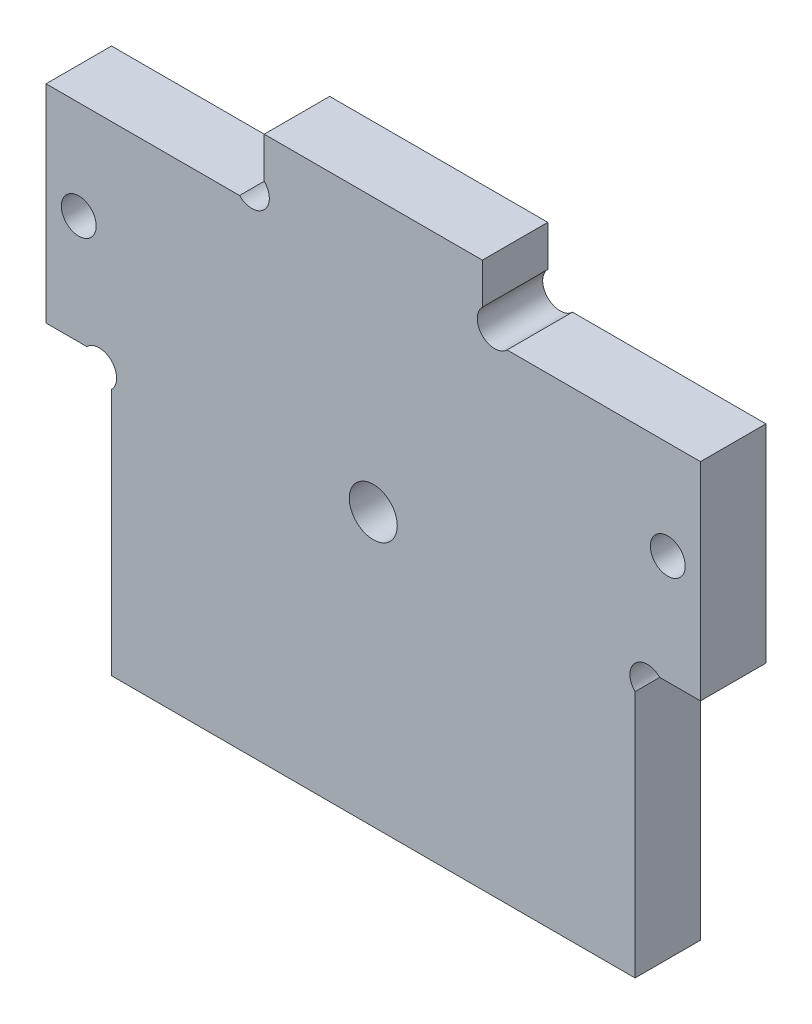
ISO-10303-21;
HEADER;
FILE_DESCRIPTION(('STEP AP214'),'2;1');
FILE_NAME('part.step','',(''),(''),'','','');
FILE_SCHEMA(('AUTOMOTIVE_DESIGN { 1 0 10303 214 1 1 1 1 }'));
ENDSEC;
DATA;
#1=APPLICATION_CONTEXT('core data for automotive mechanical design processes');
#2=APPLICATION_PROTOCOL_DEFINITION('international standard','automotive_design',2000,#1);
#3=PRODUCT_CONTEXT('',#1,'mechanical');
#4=PRODUCT('Part','Part','',(#3));
#5=PRODUCT_RELATED_PRODUCT_CATEGORY('part','',(#4));
#6=PRODUCT_DEFINITION_FORMATION('','',#4);
#7=PRODUCT_DEFINITION_CONTEXT('part definition',#1,'design');
#8=PRODUCT_DEFINITION('design','',#6,#7);
#9=PRODUCT_DEFINITION_SHAPE('','',#8);
#10=(LENGTH_UNIT() NAMED_UNIT(*) SI_UNIT(.MILLI.,.METRE.));
#11=(NAMED_UNIT(*) PLANE_ANGLE_UNIT() SI_UNIT($,.RADIAN.));
#12=(NAMED_UNIT(*) SI_UNIT($,.STERADIAN.) SOLID_ANGLE_UNIT());
#13=UNCERTAINTY_MEASURE_WITH_UNIT(LENGTH_MEASURE(1.E-05),#10,'distance_accuracy_value','');
#14=(GEOMETRIC_REPRESENTATION_CONTEXT(3) GLOBAL_UNCERTAINTY_ASSIGNED_CONTEXT((#13)) GLOBAL_UNIT_ASSIGNED_CONTEXT((#10,
#11,#12)) REPRESENTATION_CONTEXT('',''));
#15=CARTESIAN_POINT('',(0.,0.,0.));
#16=DIRECTION('',(0.,0.,1.));
#17=DIRECTION('',(1.,0.,0.));
#18=AXIS2_PLACEMENT_3D('',#15,#16,#17);
#19=CARTESIAN_POINT('',(11.1313708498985,45.1313708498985,6.));
#20=DIRECTION('',(0.,0.,1.));
#21=DIRECTION('',(1.,0.,0.));
#22=AXIS2_PLACEMENT_3D('',#19,#20,#21);
#23=PLANE('',#22);
#24=CARTESIAN_POINT('',(-27.,35.,6.));
#25=DIRECTION('',(0.,0.,1.));
#26=DIRECTION('',(-1.,0.,0.));
#27=AXIS2_PLACEMENT_3D('',#24,#25,#26);
#28=CIRCLE('',#27,1.6);
#29=CARTESIAN_POINT('',(-28.6,35.,6.));
#30=VERTEX_POINT('',#29);
#31=EDGE_CURVE('E343',#30,#30,#28,.T.);
#32=ORIENTED_EDGE('',*,*,#31,.F.);
#33=EDGE_LOOP('',(#32));
#34=FACE_BOUND('',#33,.T.);
#35=CARTESIAN_POINT('',(11.1313708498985,45.1313708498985,6.));
#36=DIRECTION('',(0.,0.,-1.));
#37=DIRECTION('',(1.,0.,0.));
#38=AXIS2_PLACEMENT_3D('',#35,#36,#37);
#39=CIRCLE('',#38,1.60000000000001);
#40=CARTESIAN_POINT('',(12.262741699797,44.,6.));
#41=VERTEX_POINT('',#40);
#42=CARTESIAN_POINT('',(10.,46.262741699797,6.));
#43=VERTEX_POINT('',#42);
#44=EDGE_CURVE('E213',#41,#43,#39,.T.);
#45=ORIENTED_EDGE('',*,*,#44,.T.);
#46=DIRECTION('',(0.,1.,0.));
#47=VECTOR('',#46,1.);
#48=CARTESIAN_POINT('',(10.,46.262741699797,6.));
#49=LINE('',#48,#47);
#50=CARTESIAN_POINT('',(10.,50.,6.));
#51=VERTEX_POINT('',#50);
#52=EDGE_CURVE('E121',#43,#51,#49,.T.);
#53=ORIENTED_EDGE('',*,*,#52,.T.);
#54=DIRECTION('',(-1.,0.,0.));
#55=VECTOR('',#54,1.);
#56=CARTESIAN_POINT('',(-10.,50.,6.));
#57=LINE('',#56,#55);
#58=CARTESIAN_POINT('',(-10.,50.,6.));
#59=VERTEX_POINT('',#58);
#60=EDGE_CURVE('E252',#51,#59,#57,.T.);
#61=ORIENTED_EDGE('',*,*,#60,.T.);
#62=DIRECTION('',(0.,-1.,0.));
#63=VECTOR('',#62,1.);
#64=CARTESIAN_POINT('',(-10.,46.262741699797,6.));
#65=LINE('',#64,#63);
#66=CARTESIAN_POINT('',(-10.,46.262741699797,6.));
#67=VERTEX_POINT('',#66);
#68=EDGE_CURVE('E271',#59,#67,#65,.T.);
#69=ORIENTED_EDGE('',*,*,#68,.T.);
#70=CARTESIAN_POINT('',(-11.1313708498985,45.1313708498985,6.));
#71=DIRECTION('',(0.,0.,-1.));
#72=DIRECTION('',(-1.,0.,0.));
#73=AXIS2_PLACEMENT_3D('',#70,#71,#72);
#74=CIRCLE('',#73,1.60000000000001);
#75=CARTESIAN_POINT('',(-12.262741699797,44.,6.));
#76=VERTEX_POINT('',#75);
#77=EDGE_CURVE('E268',#67,#76,#74,.T.);
#78=ORIENTED_EDGE('',*,*,#77,.T.);
#79=DIRECTION('',(-1.,0.,0.));
#80=VECTOR('',#79,1.);
#81=CARTESIAN_POINT('',(-12.262741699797,44.,6.));
#82=LINE('',#81,#80);
#83=CARTESIAN_POINT('',(-30.,44.,6.));
#84=VERTEX_POINT('',#83);
#85=EDGE_CURVE('E270',#76,#84,#82,.T.);
#86=ORIENTED_EDGE('',*,*,#85,.T.);
#87=DIRECTION('',(0.,-1.,0.));
#88=VECTOR('',#87,1.);
#89=CARTESIAN_POINT('',(-30.,44.,6.));
#90=LINE('',#89,#88);
#91=CARTESIAN_POINT('',(-30.,25.,6.));
#92=VERTEX_POINT('',#91);
#93=EDGE_CURVE('E273',#84,#92,#90,.T.);
#94=ORIENTED_EDGE('',*,*,#93,.T.);
#95=DIRECTION('',(1.,0.,0.));
#96=VECTOR('',#95,1.);
#97=CARTESIAN_POINT('',(-30.,25.,6.));
#98=LINE('',#97,#96);
#99=CARTESIAN_POINT('',(-26.262741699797,25.,6.));
#100=VERTEX_POINT('',#99);
#101=EDGE_CURVE('E279',#92,#100,#98,.T.);
#102=ORIENTED_EDGE('',*,*,#101,.T.);
#103=CARTESIAN_POINT('',(-25.1313708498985,23.8686291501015,6.));
#104=DIRECTION('',(0.,0.,-1.));
#105=DIRECTION('',(-1.,0.,0.));
#106=AXIS2_PLACEMENT_3D('',#103,#104,#105);
#107=CIRCLE('',#106,1.60000000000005);
#108=CARTESIAN_POINT('',(-24.,22.737258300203,6.));
#109=VERTEX_POINT('',#108);
#110=EDGE_CURVE('E281',#100,#109,#107,.T.);
#111=ORIENTED_EDGE('',*,*,#110,.T.);
#112=DIRECTION('',(0.,-1.,0.));
#113=VECTOR('',#112,1.);
#114=CARTESIAN_POINT('',(-24.,22.737258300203,6.));
#115=LINE('',#114,#113);
#116=CARTESIAN_POINT('',(-24.,0.,6.));
#117=VERTEX_POINT('',#116);
#118=EDGE_CURVE('E283',#109,#117,#115,.T.);
#119=ORIENTED_EDGE('',*,*,#118,.T.);
#120=DIRECTION('',(1.,0.,0.));
#121=VECTOR('',#120,1.);
#122=CARTESIAN_POINT('',(-24.,0.,6.));
#123=LINE('',#122,#121);
#124=CARTESIAN_POINT('',(24.,0.,6.));
#125=VERTEX_POINT('',#124);
#126=EDGE_CURVE('E285',#117,#125,#123,.T.);
#127=ORIENTED_EDGE('',*,*,#126,.T.);
#128=DIRECTION('',(0.,1.,0.));
#129=VECTOR('',#128,1.);
#130=CARTESIAN_POINT('',(24.,22.737258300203,6.));
#131=LINE('',#130,#129);
#132=CARTESIAN_POINT('',(24.,22.737258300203,6.));
#133=VERTEX_POINT('',#132);
#134=EDGE_CURVE('E287',#125,#133,#131,.T.);
#135=ORIENTED_EDGE('',*,*,#134,.T.);
#136=CARTESIAN_POINT('',(25.1313708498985,23.8686291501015,6.));
#137=DIRECTION('',(0.,0.,-1.));
#138=DIRECTION('',(1.,0.,0.));
#139=AXIS2_PLACEMENT_3D('',#136,#137,#138);
#140=CIRCLE('',#139,1.60000000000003);
#141=CARTESIAN_POINT('',(26.262741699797,25.,6.));
#142=VERTEX_POINT('',#141);
#143=EDGE_CURVE('E164',#133,#142,#140,.T.);
#144=ORIENTED_EDGE('',*,*,#143,.T.);
#145=DIRECTION('',(1.,0.,0.));
#146=VECTOR('',#145,1.);
#147=CARTESIAN_POINT('',(30.,25.,6.));
#148=LINE('',#147,#146);
#149=CARTESIAN_POINT('',(30.,25.,6.));
#150=VERTEX_POINT('',#149);
#151=EDGE_CURVE('E158',#142,#150,#148,.T.);
#152=ORIENTED_EDGE('',*,*,#151,.T.);
#153=DIRECTION('',(0.,1.,0.));
#154=VECTOR('',#153,1.);
#155=CARTESIAN_POINT('',(30.,44.,6.));
#156=LINE('',#155,#154);
#157=CARTESIAN_POINT('',(30.,44.,6.));
#158=VERTEX_POINT('',#157);
#159=EDGE_CURVE('E162',#150,#158,#156,.T.);
#160=ORIENTED_EDGE('',*,*,#159,.T.);
#161=DIRECTION('',(-1.,0.,0.));
#162=VECTOR('',#161,1.);
#163=CARTESIAN_POINT('',(12.262741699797,44.,6.));
#164=LINE('',#163,#162);
#165=EDGE_CURVE('E54',#158,#41,#164,.T.);
#166=ORIENTED_EDGE('',*,*,#165,.T.);
#167=EDGE_LOOP('',(#45,#53,#61,#69,#78,#86,#94,#102,#111,#119,#127,#135,#144,#152,#160,#166));
#168=FACE_BOUND('',#167,.T.);
#169=CARTESIAN_POINT('',(27.,35.,6.));
#170=DIRECTION('',(0.,0.,1.));
#171=DIRECTION('',(1.,0.,0.));
#172=AXIS2_PLACEMENT_3D('',#169,#170,#171);
#173=CIRCLE('',#172,1.6);
#174=CARTESIAN_POINT('',(28.6,35.,6.));
#175=VERTEX_POINT('',#174);
#176=EDGE_CURVE('E186',#175,#175,#173,.T.);
#177=ORIENTED_EDGE('',*,*,#176,.F.);
#178=EDGE_LOOP('',(#177));
#179=FACE_BOUND('',#178,.T.);
#180=CARTESIAN_POINT('',(0.,25.,6.));
#181=DIRECTION('',(0.,0.,1.));
#182=DIRECTION('',(1.,0.,0.));
#183=AXIS2_PLACEMENT_3D('',#180,#181,#182);
#184=CIRCLE('',#183,2.2);
#185=CARTESIAN_POINT('',(2.2,25.,6.));
#186=VERTEX_POINT('',#185);
#187=EDGE_CURVE('E334',#186,#186,#184,.T.);
#188=ORIENTED_EDGE('',*,*,#187,.F.);
#189=EDGE_LOOP('',(#188));
#190=FACE_BOUND('',#189,.T.);
#191=ADVANCED_FACE('F37',(#34,#168,#179,#190),#23,.T.);
#192=CARTESIAN_POINT('',(11.1313708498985,45.1313708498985,0.));
#193=DIRECTION('',(0.,0.,1.));
#194=DIRECTION('',(1.,0.,0.));
#195=AXIS2_PLACEMENT_3D('',#192,#193,#194);
#196=PLANE('',#195);
#197=CARTESIAN_POINT('',(-27.,35.,0.));
#198=DIRECTION('',(0.,0.,1.));
#199=DIRECTION('',(-1.,0.,0.));
#200=AXIS2_PLACEMENT_3D('',#197,#198,#199);
#201=CIRCLE('',#200,1.6);
#202=CARTESIAN_POINT('',(-28.6,35.,0.));
#203=VERTEX_POINT('',#202);
#204=EDGE_CURVE('E340',#203,#203,#201,.T.);
#205=ORIENTED_EDGE('',*,*,#204,.T.);
#206=EDGE_LOOP('',(#205));
#207=FACE_BOUND('',#206,.T.);
#208=CARTESIAN_POINT('',(11.1313708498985,45.1313708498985,0.));
#209=DIRECTION('',(0.,0.,-1.));
#210=DIRECTION('',(1.,0.,0.));
#211=AXIS2_PLACEMENT_3D('',#208,#209,#210);
#212=CIRCLE('',#211,1.60000000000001);
#213=CARTESIAN_POINT('',(12.262741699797,44.,0.));
#214=VERTEX_POINT('',#213);
#215=CARTESIAN_POINT('',(10.,46.262741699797,0.));
#216=VERTEX_POINT('',#215);
#217=EDGE_CURVE('E182',#214,#216,#212,.T.);
#218=ORIENTED_EDGE('',*,*,#217,.F.);
#219=DIRECTION('',(-1.,0.,0.));
#220=VECTOR('',#219,1.);
#221=CARTESIAN_POINT('',(12.262741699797,44.,0.));
#222=LINE('',#221,#220);
#223=CARTESIAN_POINT('',(30.,44.,0.));
#224=VERTEX_POINT('',#223);
#225=EDGE_CURVE('E113',#224,#214,#222,.T.);
#226=ORIENTED_EDGE('',*,*,#225,.F.);
#227=DIRECTION('',(0.,1.,0.));
#228=VECTOR('',#227,1.);
#229=CARTESIAN_POINT('',(30.,44.,0.));
#230=LINE('',#229,#228);
#231=CARTESIAN_POINT('',(30.,25.,0.));
#232=VERTEX_POINT('',#231);
#233=EDGE_CURVE('E107',#232,#224,#230,.T.);
#234=ORIENTED_EDGE('',*,*,#233,.F.);
#235=DIRECTION('',(1.,0.,0.));
#236=VECTOR('',#235,1.);
#237=CARTESIAN_POINT('',(30.,25.,0.));
#238=LINE('',#237,#236);
#239=CARTESIAN_POINT('',(26.262741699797,25.,0.));
#240=VERTEX_POINT('',#239);
#241=EDGE_CURVE('E172',#240,#232,#238,.T.);
#242=ORIENTED_EDGE('',*,*,#241,.F.);
#243=CARTESIAN_POINT('',(25.1313708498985,23.8686291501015,0.));
#244=DIRECTION('',(0.,0.,-1.));
#245=DIRECTION('',(1.,0.,0.));
#246=AXIS2_PLACEMENT_3D('',#243,#244,#245);
#247=CIRCLE('',#246,1.60000000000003);
#248=CARTESIAN_POINT('',(24.,22.737258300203,0.));
#249=VERTEX_POINT('',#248);
#250=EDGE_CURVE('E208',#249,#240,#247,.T.);
#251=ORIENTED_EDGE('',*,*,#250,.F.);
#252=DIRECTION('',(0.,1.,0.));
#253=VECTOR('',#252,1.);
#254=CARTESIAN_POINT('',(24.,22.737258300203,0.));
#255=LINE('',#254,#253);
#256=CARTESIAN_POINT('',(24.,0.,0.));
#257=VERTEX_POINT('',#256);
#258=EDGE_CURVE('E206',#257,#249,#255,.T.);
#259=ORIENTED_EDGE('',*,*,#258,.F.);
#260=DIRECTION('',(1.,0.,0.));
#261=VECTOR('',#260,1.);
#262=CARTESIAN_POINT('',(-24.,0.,0.));
#263=LINE('',#262,#261);
#264=CARTESIAN_POINT('',(-24.,0.,0.));
#265=VERTEX_POINT('',#264);
#266=EDGE_CURVE('E204',#265,#257,#263,.T.);
#267=ORIENTED_EDGE('',*,*,#266,.F.);
#268=DIRECTION('',(0.,-1.,0.));
#269=VECTOR('',#268,1.);
#270=CARTESIAN_POINT('',(-24.,22.737258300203,0.));
#271=LINE('',#270,#269);
#272=CARTESIAN_POINT('',(-24.,22.737258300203,0.));
#273=VERTEX_POINT('',#272);
#274=EDGE_CURVE('E202',#273,#265,#271,.T.);
#275=ORIENTED_EDGE('',*,*,#274,.F.);
#276=CARTESIAN_POINT('',(-25.1313708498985,23.8686291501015,0.));
#277=DIRECTION('',(0.,0.,-1.));
#278=DIRECTION('',(-1.,0.,0.));
#279=AXIS2_PLACEMENT_3D('',#276,#277,#278);
#280=CIRCLE('',#279,1.60000000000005);
#281=CARTESIAN_POINT('',(-26.262741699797,25.,0.));
#282=VERTEX_POINT('',#281);
#283=EDGE_CURVE('E200',#282,#273,#280,.T.);
#284=ORIENTED_EDGE('',*,*,#283,.F.);
#285=DIRECTION('',(1.,0.,0.));
#286=VECTOR('',#285,1.);
#287=CARTESIAN_POINT('',(-30.,25.,0.));
#288=LINE('',#287,#286);
#289=CARTESIAN_POINT('',(-30.,25.,0.));
#290=VERTEX_POINT('',#289);
#291=EDGE_CURVE('E198',#290,#282,#288,.T.);
#292=ORIENTED_EDGE('',*,*,#291,.F.);
#293=DIRECTION('',(0.,-1.,0.));
#294=VECTOR('',#293,1.);
#295=CARTESIAN_POINT('',(-30.,44.,0.));
#296=LINE('',#295,#294);
#297=CARTESIAN_POINT('',(-30.,44.,0.));
#298=VERTEX_POINT('',#297);
#299=EDGE_CURVE('E196',#298,#290,#296,.T.);
#300=ORIENTED_EDGE('',*,*,#299,.F.);
#301=DIRECTION('',(-1.,0.,0.));
#302=VECTOR('',#301,1.);
#303=CARTESIAN_POINT('',(-12.262741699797,44.,0.));
#304=LINE('',#303,#302);
#305=CARTESIAN_POINT('',(-12.262741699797,44.,0.));
#306=VERTEX_POINT('',#305);
#307=EDGE_CURVE('E194',#306,#298,#304,.T.);
#308=ORIENTED_EDGE('',*,*,#307,.F.);
#309=CARTESIAN_POINT('',(-11.1313708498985,45.1313708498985,0.));
#310=DIRECTION('',(0.,0.,-1.));
#311=DIRECTION('',(-1.,0.,0.));
#312=AXIS2_PLACEMENT_3D('',#309,#310,#311);
#313=CIRCLE('',#312,1.60000000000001);
#314=CARTESIAN_POINT('',(-10.,46.262741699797,0.));
#315=VERTEX_POINT('',#314);
#316=EDGE_CURVE('E192',#315,#306,#313,.T.);
#317=ORIENTED_EDGE('',*,*,#316,.F.);
#318=DIRECTION('',(0.,-1.,0.));
#319=VECTOR('',#318,1.);
#320=CARTESIAN_POINT('',(-10.,46.262741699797,0.));
#321=LINE('',#320,#319);
#322=CARTESIAN_POINT('',(-10.,50.,0.));
#323=VERTEX_POINT('',#322);
#324=EDGE_CURVE('E190',#323,#315,#321,.T.);
#325=ORIENTED_EDGE('',*,*,#324,.F.);
#326=DIRECTION('',(-1.,0.,0.));
#327=VECTOR('',#326,1.);
#328=CARTESIAN_POINT('',(-10.,50.,0.));
#329=LINE('',#328,#327);
#330=CARTESIAN_POINT('',(10.,50.,0.));
#331=VERTEX_POINT('',#330);
#332=EDGE_CURVE('E188',#331,#323,#329,.T.);
#333=ORIENTED_EDGE('',*,*,#332,.F.);
#334=DIRECTION('',(0.,1.,0.));
#335=VECTOR('',#334,1.);
#336=CARTESIAN_POINT('',(10.,46.262741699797,0.));
#337=LINE('',#336,#335);
#338=EDGE_CURVE('E185',#216,#331,#337,.T.);
#339=ORIENTED_EDGE('',*,*,#338,.F.);
#340=EDGE_LOOP('',(#218,#226,#234,#242,#251,#259,#267,#275,#284,#292,#300,#308,#317,#325,#333,#339));
#341=FACE_BOUND('',#340,.T.);
#342=CARTESIAN_POINT('',(27.,35.,0.));
#343=DIRECTION('',(0.,0.,1.));
#344=DIRECTION('',(1.,0.,0.));
#345=AXIS2_PLACEMENT_3D('',#342,#343,#344);
#346=CIRCLE('',#345,1.6);
#347=CARTESIAN_POINT('',(28.6,35.,0.));
#348=VERTEX_POINT('',#347);
#349=EDGE_CURVE('E346',#348,#348,#346,.T.);
#350=ORIENTED_EDGE('',*,*,#349,.T.);
#351=EDGE_LOOP('',(#350));
#352=FACE_BOUND('',#351,.T.);
#353=CARTESIAN_POINT('',(0.,25.,0.));
#354=DIRECTION('',(0.,0.,1.));
#355=DIRECTION('',(1.,0.,0.));
#356=AXIS2_PLACEMENT_3D('',#353,#354,#355);
#357=CIRCLE('',#356,2.2);
#358=CARTESIAN_POINT('',(2.2,25.,0.));
#359=VERTEX_POINT('',#358);
#360=EDGE_CURVE('E337',#359,#359,#357,.T.);
#361=ORIENTED_EDGE('',*,*,#360,.T.);
#362=EDGE_LOOP('',(#361));
#363=FACE_BOUND('',#362,.T.);
#364=ADVANCED_FACE('F256',(#207,#341,#352,#363),#196,.F.);
#365=CARTESIAN_POINT('',(11.1313708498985,45.1313708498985,6.));
#366=DIRECTION('',(0.,0.,-1.));
#367=DIRECTION('',(-1.,0.,0.));
#368=AXIS2_PLACEMENT_3D('',#365,#366,#367);
#369=CYLINDRICAL_SURFACE('',#368,1.60000000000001);
#370=ORIENTED_EDGE('',*,*,#217,.T.);
#371=DIRECTION('',(0.,0.,-1.));
#372=VECTOR('',#371,1.);
#373=CARTESIAN_POINT('',(10.,46.262741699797,6.));
#374=LINE('',#373,#372);
#375=EDGE_CURVE('E11',#43,#216,#374,.T.);
#376=ORIENTED_EDGE('',*,*,#375,.F.);
#377=ORIENTED_EDGE('',*,*,#44,.F.);
#378=DIRECTION('',(0.,0.,-1.));
#379=VECTOR('',#378,1.);
#380=CARTESIAN_POINT('',(12.262741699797,44.,6.));
#381=LINE('',#380,#379);
#382=EDGE_CURVE('E178',#41,#214,#381,.T.);
#383=ORIENTED_EDGE('',*,*,#382,.T.);
#384=EDGE_LOOP('',(#370,#376,#377,#383));
#385=FACE_BOUND('',#384,.T.);
#386=ADVANCED_FACE('F39',(#385),#369,.F.);
#387=CARTESIAN_POINT('',(10.,46.262741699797,6.));
#388=DIRECTION('',(-1.,0.,0.));
#389=DIRECTION('',(0.,0.,1.));
#390=AXIS2_PLACEMENT_3D('',#387,#388,#389);
#391=PLANE('',#390);
#392=ORIENTED_EDGE('',*,*,#338,.T.);
#393=DIRECTION('',(0.,0.,-1.));
#394=VECTOR('',#393,1.);
#395=CARTESIAN_POINT('',(10.,50.,6.));
#396=LINE('',#395,#394);
#397=EDGE_CURVE('E46',#51,#331,#396,.T.);
#398=ORIENTED_EDGE('',*,*,#397,.F.);
#399=ORIENTED_EDGE('',*,*,#52,.F.);
#400=ORIENTED_EDGE('',*,*,#375,.T.);
#401=EDGE_LOOP('',(#392,#398,#399,#400));
#402=FACE_BOUND('',#401,.T.);
#403=ADVANCED_FACE('F487',(#402),#391,.F.);
#404=CARTESIAN_POINT('',(-10.,50.,6.));
#405=DIRECTION('',(0.,-1.,0.));
#406=DIRECTION('',(0.,0.,-1.));
#407=AXIS2_PLACEMENT_3D('',#404,#405,#406);
#408=PLANE('',#407);
#409=ORIENTED_EDGE('',*,*,#332,.T.);
#410=DIRECTION('',(0.,0.,-1.));
#411=VECTOR('',#410,1.);
#412=CARTESIAN_POINT('',(-10.,50.,6.));
#413=LINE('',#412,#411);
#414=EDGE_CURVE('E244',#59,#323,#413,.T.);
#415=ORIENTED_EDGE('',*,*,#414,.F.);
#416=ORIENTED_EDGE('',*,*,#60,.F.);
#417=ORIENTED_EDGE('',*,*,#397,.T.);
#418=EDGE_LOOP('',(#409,#415,#416,#417));
#419=FACE_BOUND('',#418,.T.);
#420=ADVANCED_FACE('F250',(#419),#408,.F.);
#421=CARTESIAN_POINT('',(-10.,46.262741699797,6.));
#422=DIRECTION('',(1.,0.,0.));
#423=DIRECTION('',(0.,1.,0.));
#424=AXIS2_PLACEMENT_3D('',#421,#422,#423);
#425=PLANE('',#424);
#426=ORIENTED_EDGE('',*,*,#324,.T.);
#427=DIRECTION('',(0.,0.,-1.));
#428=VECTOR('',#427,1.);
#429=CARTESIAN_POINT('',(-10.,46.262741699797,6.));
#430=LINE('',#429,#428);
#431=EDGE_CURVE('E241',#67,#315,#430,.T.);
#432=ORIENTED_EDGE('',*,*,#431,.F.);
#433=ORIENTED_EDGE('',*,*,#68,.F.);
#434=ORIENTED_EDGE('',*,*,#414,.T.);
#435=EDGE_LOOP('',(#426,#432,#433,#434));
#436=FACE_BOUND('',#435,.T.);
#437=ADVANCED_FACE('F262',(#436),#425,.F.);
#438=CARTESIAN_POINT('',(-11.1313708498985,45.1313708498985,6.));
#439=DIRECTION('',(0.,0.,-1.));
#440=DIRECTION('',(-1.,0.,0.));
#441=AXIS2_PLACEMENT_3D('',#438,#439,#440);
#442=CYLINDRICAL_SURFACE('',#441,1.60000000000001);
#443=ORIENTED_EDGE('',*,*,#316,.T.);
#444=DIRECTION('',(0.,0.,-1.));
#445=VECTOR('',#444,1.);
#446=CARTESIAN_POINT('',(-12.262741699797,44.,6.));
#447=LINE('',#446,#445);
#448=EDGE_CURVE('E238',#76,#306,#447,.T.);
#449=ORIENTED_EDGE('',*,*,#448,.F.);
#450=ORIENTED_EDGE('',*,*,#77,.F.);
#451=ORIENTED_EDGE('',*,*,#431,.T.);
#452=EDGE_LOOP('',(#443,#449,#450,#451));
#453=FACE_BOUND('',#452,.T.);
#454=ADVANCED_FACE('F266',(#453),#442,.F.);
#455=CARTESIAN_POINT('',(-12.262741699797,44.,6.));
#456=DIRECTION('',(0.,-1.,0.));
#457=DIRECTION('',(0.,0.,-1.));
#458=AXIS2_PLACEMENT_3D('',#455,#456,#457);
#459=PLANE('',#458);
#460=ORIENTED_EDGE('',*,*,#307,.T.);
#461=DIRECTION('',(0.,0.,-1.));
#462=VECTOR('',#461,1.);
#463=CARTESIAN_POINT('',(-30.,44.,6.));
#464=LINE('',#463,#462);
#465=EDGE_CURVE('E235',#84,#298,#464,.T.);
#466=ORIENTED_EDGE('',*,*,#465,.F.);
#467=ORIENTED_EDGE('',*,*,#85,.F.);
#468=ORIENTED_EDGE('',*,*,#448,.T.);
#469=EDGE_LOOP('',(#460,#466,#467,#468));
#470=FACE_BOUND('',#469,.T.);
#471=ADVANCED_FACE('F452',(#470),#459,.F.);
#472=CARTESIAN_POINT('',(-30.,44.,6.));
#473=DIRECTION('',(1.,0.,0.));
#474=DIRECTION('',(0.,0.,-1.));
#475=AXIS2_PLACEMENT_3D('',#472,#473,#474);
#476=PLANE('',#475);
#477=ORIENTED_EDGE('',*,*,#299,.T.);
#478=DIRECTION('',(0.,0.,-1.));
#479=VECTOR('',#478,1.);
#480=CARTESIAN_POINT('',(-30.,25.,6.));
#481=LINE('',#480,#479);
#482=EDGE_CURVE('E232',#92,#290,#481,.T.);
#483=ORIENTED_EDGE('',*,*,#482,.F.);
#484=ORIENTED_EDGE('',*,*,#93,.F.);
#485=ORIENTED_EDGE('',*,*,#465,.T.);
#486=EDGE_LOOP('',(#477,#483,#484,#485));
#487=FACE_BOUND('',#486,.T.);
#488=ADVANCED_FACE('F442',(#487),#476,.F.);
#489=CARTESIAN_POINT('',(-30.,25.,6.));
#490=DIRECTION('',(0.,1.,0.));
#491=DIRECTION('',(-1.,0.,0.));
#492=AXIS2_PLACEMENT_3D('',#489,#490,#491);
#493=PLANE('',#492);
#494=ORIENTED_EDGE('',*,*,#291,.T.);
#495=DIRECTION('',(0.,0.,-1.));
#496=VECTOR('',#495,1.);
#497=CARTESIAN_POINT('',(-26.262741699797,25.,6.));
#498=LINE('',#497,#496);
#499=EDGE_CURVE('E229',#100,#282,#498,.T.);
#500=ORIENTED_EDGE('',*,*,#499,.F.);
#501=ORIENTED_EDGE('',*,*,#101,.F.);
#502=ORIENTED_EDGE('',*,*,#482,.T.);
#503=EDGE_LOOP('',(#494,#500,#501,#502));
#504=FACE_BOUND('',#503,.T.);
#505=ADVANCED_FACE('F432',(#504),#493,.F.);
#506=CARTESIAN_POINT('',(-25.1313708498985,23.8686291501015,6.));
#507=DIRECTION('',(0.,0.,-1.));
#508=DIRECTION('',(-1.,0.,0.));
#509=AXIS2_PLACEMENT_3D('',#506,#507,#508);
#510=CYLINDRICAL_SURFACE('',#509,1.60000000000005);
#511=ORIENTED_EDGE('',*,*,#283,.T.);
#512=DIRECTION('',(0.,0.,-1.));
#513=VECTOR('',#512,1.);
#514=CARTESIAN_POINT('',(-24.,22.737258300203,6.));
#515=LINE('',#514,#513);
#516=EDGE_CURVE('E226',#109,#273,#515,.T.);
#517=ORIENTED_EDGE('',*,*,#516,.F.);
#518=ORIENTED_EDGE('',*,*,#110,.F.);
#519=ORIENTED_EDGE('',*,*,#499,.T.);
#520=EDGE_LOOP('',(#511,#517,#518,#519));
#521=FACE_BOUND('',#520,.T.);
#522=ADVANCED_FACE('F422',(#521),#510,.F.);
#523=CARTESIAN_POINT('',(-24.,22.737258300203,6.));
#524=DIRECTION('',(1.,0.,0.));
#525=DIRECTION('',(0.,1.,0.));
#526=AXIS2_PLACEMENT_3D('',#523,#524,#525);
#527=PLANE('',#526);
#528=ORIENTED_EDGE('',*,*,#274,.T.);
#529=DIRECTION('',(0.,0.,-1.));
#530=VECTOR('',#529,1.);
#531=CARTESIAN_POINT('',(-24.,0.,6.));
#532=LINE('',#531,#530);
#533=EDGE_CURVE('E223',#117,#265,#532,.T.);
#534=ORIENTED_EDGE('',*,*,#533,.F.);
#535=ORIENTED_EDGE('',*,*,#118,.F.);
#536=ORIENTED_EDGE('',*,*,#516,.T.);
#537=EDGE_LOOP('',(#528,#534,#535,#536));
#538=FACE_BOUND('',#537,.T.);
#539=ADVANCED_FACE('F412',(#538),#527,.F.);
#540=CARTESIAN_POINT('',(-24.,0.,6.));
#541=DIRECTION('',(0.,1.,0.));
#542=DIRECTION('',(0.,0.,1.));
#543=AXIS2_PLACEMENT_3D('',#540,#541,#542);
#544=PLANE('',#543);
#545=ORIENTED_EDGE('',*,*,#266,.T.);
#546=DIRECTION('',(0.,0.,-1.));
#547=VECTOR('',#546,1.);
#548=CARTESIAN_POINT('',(24.,0.,6.));
#549=LINE('',#548,#547);
#550=EDGE_CURVE('E220',#125,#257,#549,.T.);
#551=ORIENTED_EDGE('',*,*,#550,.F.);
#552=ORIENTED_EDGE('',*,*,#126,.F.);
#553=ORIENTED_EDGE('',*,*,#533,.T.);
#554=EDGE_LOOP('',(#545,#551,#552,#553));
#555=FACE_BOUND('',#554,.T.);
#556=ADVANCED_FACE('F403',(#555),#544,.F.);
#557=CARTESIAN_POINT('',(24.,22.737258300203,6.));
#558=DIRECTION('',(-1.,0.,0.));
#559=DIRECTION('',(0.,-1.,0.));
#560=AXIS2_PLACEMENT_3D('',#557,#558,#559);
#561=PLANE('',#560);
#562=ORIENTED_EDGE('',*,*,#258,.T.);
#563=DIRECTION('',(0.,0.,-1.));
#564=VECTOR('',#563,1.);
#565=CARTESIAN_POINT('',(24.,22.737258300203,6.));
#566=LINE('',#565,#564);
#567=EDGE_CURVE('E217',#133,#249,#566,.T.);
#568=ORIENTED_EDGE('',*,*,#567,.F.);
#569=ORIENTED_EDGE('',*,*,#134,.F.);
#570=ORIENTED_EDGE('',*,*,#550,.T.);
#571=EDGE_LOOP('',(#562,#568,#569,#570));
#572=FACE_BOUND('',#571,.T.);
#573=ADVANCED_FACE('F293',(#572),#561,.F.);
#574=CARTESIAN_POINT('',(25.1313708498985,23.8686291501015,6.));
#575=DIRECTION('',(0.,0.,-1.));
#576=DIRECTION('',(-1.,0.,0.));
#577=AXIS2_PLACEMENT_3D('',#574,#575,#576);
#578=CYLINDRICAL_SURFACE('',#577,1.60000000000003);
#579=ORIENTED_EDGE('',*,*,#250,.T.);
#580=DIRECTION('',(0.,0.,-1.));
#581=VECTOR('',#580,1.);
#582=CARTESIAN_POINT('',(26.262741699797,25.,6.));
#583=LINE('',#582,#581);
#584=EDGE_CURVE('E173',#142,#240,#583,.T.);
#585=ORIENTED_EDGE('',*,*,#584,.F.);
#586=ORIENTED_EDGE('',*,*,#143,.F.);
#587=ORIENTED_EDGE('',*,*,#567,.T.);
#588=EDGE_LOOP('',(#579,#585,#586,#587));
#589=FACE_BOUND('',#588,.T.);
#590=ADVANCED_FACE('F297',(#589),#578,.F.);
#591=CARTESIAN_POINT('',(30.,25.,6.));
#592=DIRECTION('',(0.,1.,0.));
#593=DIRECTION('',(-1.,0.,0.));
#594=AXIS2_PLACEMENT_3D('',#591,#592,#593);
#595=PLANE('',#594);
#596=ORIENTED_EDGE('',*,*,#241,.T.);
#597=DIRECTION('',(0.,0.,-1.));
#598=VECTOR('',#597,1.);
#599=CARTESIAN_POINT('',(30.,25.,6.));
#600=LINE('',#599,#598);
#601=EDGE_CURVE('E169',#150,#232,#600,.T.);
#602=ORIENTED_EDGE('',*,*,#601,.F.);
#603=ORIENTED_EDGE('',*,*,#151,.F.);
#604=ORIENTED_EDGE('',*,*,#584,.T.);
#605=EDGE_LOOP('',(#596,#602,#603,#604));
#606=FACE_BOUND('',#605,.T.);
#607=ADVANCED_FACE('F170',(#606),#595,.F.);
#608=CARTESIAN_POINT('',(30.,44.,6.));
#609=DIRECTION('',(-1.,0.,0.));
#610=DIRECTION('',(0.,0.,1.));
#611=AXIS2_PLACEMENT_3D('',#608,#609,#610);
#612=PLANE('',#611);
#613=ORIENTED_EDGE('',*,*,#233,.T.);
#614=DIRECTION('',(0.,0.,-1.));
#615=VECTOR('',#614,1.);
#616=CARTESIAN_POINT('',(30.,44.,6.));
#617=LINE('',#616,#615);
#618=EDGE_CURVE('E174',#158,#224,#617,.T.);
#619=ORIENTED_EDGE('',*,*,#618,.F.);
#620=ORIENTED_EDGE('',*,*,#159,.F.);
#621=ORIENTED_EDGE('',*,*,#601,.T.);
#622=EDGE_LOOP('',(#613,#619,#620,#621));
#623=FACE_BOUND('',#622,.T.);
#624=ADVANCED_FACE('F176',(#623),#612,.F.);
#625=CARTESIAN_POINT('',(12.262741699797,44.,6.));
#626=DIRECTION('',(0.,-1.,0.));
#627=DIRECTION('',(0.,0.,-1.));
#628=AXIS2_PLACEMENT_3D('',#625,#626,#627);
#629=PLANE('',#628);
#630=ORIENTED_EDGE('',*,*,#225,.T.);
#631=ORIENTED_EDGE('',*,*,#382,.F.);
#632=ORIENTED_EDGE('',*,*,#165,.F.);
#633=ORIENTED_EDGE('',*,*,#618,.T.);
#634=EDGE_LOOP('',(#630,#631,#632,#633));
#635=FACE_BOUND('',#634,.T.);
#636=ADVANCED_FACE('F301',(#635),#629,.F.);
#637=CARTESIAN_POINT('',(27.,35.,6.));
#638=DIRECTION('',(0.,0.,-1.));
#639=DIRECTION('',(-1.,0.,0.));
#640=AXIS2_PLACEMENT_3D('',#637,#638,#639);
#641=CYLINDRICAL_SURFACE('',#640,1.6);
#642=ORIENTED_EDGE('',*,*,#176,.T.);
#643=EDGE_LOOP('',(#642));
#644=FACE_BOUND('',#643,.T.);
#645=ORIENTED_EDGE('',*,*,#349,.F.);
#646=EDGE_LOOP('',(#645));
#647=FACE_BOUND('',#646,.T.);
#648=ADVANCED_FACE('F303',(#644,#647),#641,.F.);
#649=CARTESIAN_POINT('',(-27.,35.,6.));
#650=DIRECTION('',(0.,0.,-1.));
#651=DIRECTION('',(-1.,0.,0.));
#652=AXIS2_PLACEMENT_3D('',#649,#650,#651);
#653=CYLINDRICAL_SURFACE('',#652,1.6);
#654=ORIENTED_EDGE('',*,*,#31,.T.);
#655=EDGE_LOOP('',(#654));
#656=FACE_BOUND('',#655,.T.);
#657=ORIENTED_EDGE('',*,*,#204,.F.);
#658=EDGE_LOOP('',(#657));
#659=FACE_BOUND('',#658,.T.);
#660=ADVANCED_FACE('F309',(#656,#659),#653,.F.);
#661=CARTESIAN_POINT('',(0.,25.,6.));
#662=DIRECTION('',(0.,0.,-1.));
#663=DIRECTION('',(-1.,0.,0.));
#664=AXIS2_PLACEMENT_3D('',#661,#662,#663);
#665=CYLINDRICAL_SURFACE('',#664,2.2);
#666=ORIENTED_EDGE('',*,*,#187,.T.);
#667=EDGE_LOOP('',(#666));
#668=FACE_BOUND('',#667,.T.);
#669=ORIENTED_EDGE('',*,*,#360,.F.);
#670=EDGE_LOOP('',(#669));
#671=FACE_BOUND('',#670,.T.);
#672=ADVANCED_FACE('F325',(#668,#671),#665,.F.);
#673=CLOSED_SHELL('',(#191,#364,#386,#403,#420,#437,#454,#471,#488,#505,#522,#539,#556,#573,
#590,#607,#624,#636,#648,#660,#672));
#674=MANIFOLD_SOLID_BREP('B2',#673);
#675=ADVANCED_BREP_SHAPE_REPRESENTATION('',(#18,#674),#14);
#676=SHAPE_DEFINITION_REPRESENTATION(#9,#675);
ENDSEC;
END-ISO-10303-21;
